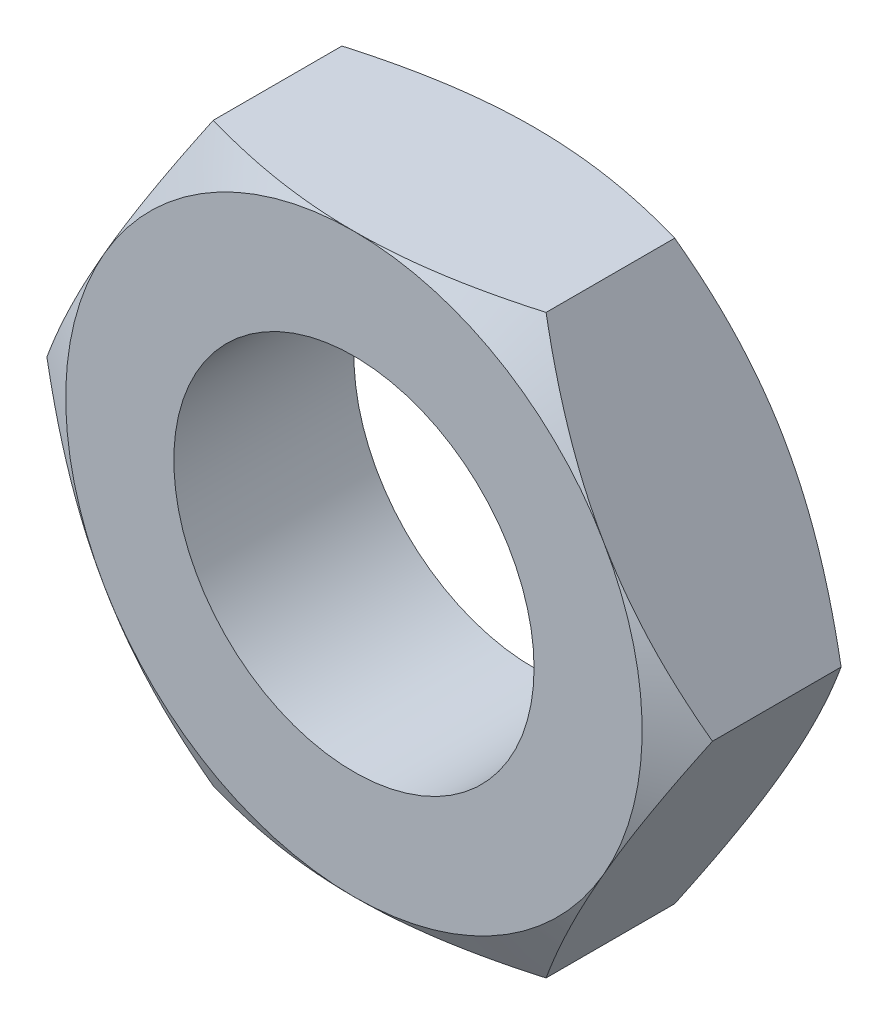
ISO-10303-21;
HEADER;
FILE_DESCRIPTION(('STEP AP214'),'2;1');
FILE_NAME('part.step','',(''),(''),'','','');
FILE_SCHEMA(('AUTOMOTIVE_DESIGN { 1 0 10303 214 1 1 1 1 }'));
ENDSEC;
DATA;
#1=APPLICATION_CONTEXT('core data for automotive mechanical design processes');
#2=APPLICATION_PROTOCOL_DEFINITION('international standard','automotive_design',2000,#1);
#3=PRODUCT_CONTEXT('',#1,'mechanical');
#4=PRODUCT('Part','Part','',(#3));
#5=PRODUCT_RELATED_PRODUCT_CATEGORY('part','',(#4));
#6=PRODUCT_DEFINITION_FORMATION('','',#4);
#7=PRODUCT_DEFINITION_CONTEXT('part definition',#1,'design');
#8=PRODUCT_DEFINITION('design','',#6,#7);
#9=PRODUCT_DEFINITION_SHAPE('','',#8);
#10=(LENGTH_UNIT() NAMED_UNIT(*) SI_UNIT(.MILLI.,.METRE.));
#11=(NAMED_UNIT(*) PLANE_ANGLE_UNIT() SI_UNIT($,.RADIAN.));
#12=(NAMED_UNIT(*) SI_UNIT($,.STERADIAN.) SOLID_ANGLE_UNIT());
#13=UNCERTAINTY_MEASURE_WITH_UNIT(LENGTH_MEASURE(1.E-05),#10,'distance_accuracy_value','');
#14=(GEOMETRIC_REPRESENTATION_CONTEXT(3) GLOBAL_UNCERTAINTY_ASSIGNED_CONTEXT((#13)) GLOBAL_UNIT_ASSIGNED_CONTEXT((#10,
#11,#12)) REPRESENTATION_CONTEXT('',''));
#15=CARTESIAN_POINT('',(0.,0.,0.));
#16=DIRECTION('',(0.,0.,1.));
#17=DIRECTION('',(1.,0.,0.));
#18=AXIS2_PLACEMENT_3D('',#15,#16,#17);
#19=CARTESIAN_POINT('',(9.23760430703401,0.,2.5));
#20=DIRECTION('',(-0.866025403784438,-0.5,0.));
#21=DIRECTION('',(0.5,-0.866025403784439,0.));
#22=AXIS2_PLACEMENT_3D('',#19,#20,#21);
#23=PLANE('',#22);
#24=CARTESIAN_POINT('',(4.61868668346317,8.0002,-1.78540215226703));
#25=CARTESIAN_POINT('',(4.72021302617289,7.8243512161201,-1.84400928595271));
#26=CARTESIAN_POINT('',(4.82211789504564,7.64784680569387,-1.89995659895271));
#27=CARTESIAN_POINT('',(5.02675523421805,7.29340453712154,-2.00579899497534));
#28=CARTESIAN_POINT('',(5.12948804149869,7.11546609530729,-2.05569146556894));
#29=CARTESIAN_POINT('',(5.43933133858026,6.57880176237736,-2.19530720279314));
#30=CARTESIAN_POINT('',(5.64766491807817,6.21795741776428,-2.27471882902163));
#31=CARTESIAN_POINT('',(5.95943209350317,5.67796082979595,-2.36783835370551));
#32=CARTESIAN_POINT('',(6.06193429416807,5.50042181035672,-2.39436541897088));
#33=CARTESIAN_POINT('',(6.26740224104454,5.14454088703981,-2.43884682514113));
#34=CARTESIAN_POINT('',(6.37036794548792,4.96619905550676,-2.45680192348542));
#35=CARTESIAN_POINT('',(6.57647664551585,4.60920831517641,-2.48368435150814));
#36=CARTESIAN_POINT('',(6.67961930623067,4.4305599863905,-2.49262192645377));
#37=CARTESIAN_POINT('',(6.88599991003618,4.07309829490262,-2.50127769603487));
#38=CARTESIAN_POINT('',(6.98923785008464,3.89428493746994,-2.50099617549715));
#39=CARTESIAN_POINT('',(7.18224506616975,3.5599866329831,-2.49185497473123));
#40=CARTESIAN_POINT('',(7.27202796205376,3.40447809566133,-2.48411039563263));
#41=CARTESIAN_POINT('',(7.45138347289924,3.09382523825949,-2.46179886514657));
#42=CARTESIAN_POINT('',(7.5409560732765,2.93868094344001,-2.44723145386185));
#43=CARTESIAN_POINT('',(7.80932710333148,2.47384868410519,-2.39363930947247));
#44=CARTESIAN_POINT('',(7.98765049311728,2.16498351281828,-2.34473135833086));
#45=CARTESIAN_POINT('',(8.34618890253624,1.5439767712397,-2.22246059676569));
#46=CARTESIAN_POINT('',(8.52635816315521,1.23191445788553,-2.14857947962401));
#47=CARTESIAN_POINT('',(8.88400987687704,0.612443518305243,-1.98089985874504));
#48=CARTESIAN_POINT('',(9.06149691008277,0.305026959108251,-1.88714073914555));
#49=CARTESIAN_POINT('',(9.23771977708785,-0.000199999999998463,-1.78540215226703));
#50=B_SPLINE_CURVE_WITH_KNOTS('',3,(#24,#25,#26,#27,#28,#29,#30,#31,#32,#33,#34,#35,#36,#37,#38,
#39,#40,#41,#42,#43,#44,#45,#46,#47,#48,#49),.UNSPECIFIED.,.F.,.F.,(4,2,2,2,2,2,2,2,2,2,2,2,4),
(0.,0.633973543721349,1.26821965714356,2.53934712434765,3.15934343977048,3.77928496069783,
4.39852133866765,5.01773858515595,5.55680239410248,6.09590254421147,7.17487077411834,
8.27776850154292,9.37850115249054),.UNSPECIFIED.);
#51=CARTESIAN_POINT('',(4.618802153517,8.,-1.78546882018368));
#52=VERTEX_POINT('',#51);
#53=CARTESIAN_POINT('',(6.92820323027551,4.,-2.5));
#54=VERTEX_POINT('',#53);
#55=EDGE_CURVE('E127',#52,#54,#50,.T.);
#56=ORIENTED_EDGE('',*,*,#55,.F.);
#57=DIRECTION('',(0.,0.,-1.));
#58=VECTOR('',#57,1.);
#59=CARTESIAN_POINT('',(4.618802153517,8.,2.5));
#60=LINE('',#59,#58);
#61=CARTESIAN_POINT('',(4.618802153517,8.,1.78546882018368));
#62=VERTEX_POINT('',#61);
#63=EDGE_CURVE('E269',#62,#52,#60,.T.);
#64=ORIENTED_EDGE('',*,*,#63,.F.);
#65=CARTESIAN_POINT('',(9.23771977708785,-0.00019999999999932,1.78540215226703));
#66=CARTESIAN_POINT('',(9.13619343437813,0.175648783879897,1.84400928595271));
#67=CARTESIAN_POINT('',(9.03428856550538,0.352153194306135,1.89995659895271));
#68=CARTESIAN_POINT('',(8.82965122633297,0.706595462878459,2.00579899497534));
#69=CARTESIAN_POINT('',(8.72691841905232,0.884533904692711,2.05569146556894));
#70=CARTESIAN_POINT('',(8.41707512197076,1.42119823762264,2.19530720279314));
#71=CARTESIAN_POINT('',(8.20874154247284,1.78204258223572,2.27471882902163));
#72=CARTESIAN_POINT('',(7.89697436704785,2.32203917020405,2.36783835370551));
#73=CARTESIAN_POINT('',(7.79447216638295,2.49957818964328,2.39436541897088));
#74=CARTESIAN_POINT('',(7.58900421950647,2.8554591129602,2.43884682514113));
#75=CARTESIAN_POINT('',(7.4860385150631,3.03380094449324,2.45680192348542));
#76=CARTESIAN_POINT('',(7.27992981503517,3.39079168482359,2.48368435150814));
#77=CARTESIAN_POINT('',(7.17678715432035,3.5694400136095,2.49262192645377));
#78=CARTESIAN_POINT('',(6.97040655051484,3.92690170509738,2.50127769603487));
#79=CARTESIAN_POINT('',(6.86716861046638,4.10571506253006,2.50099617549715));
#80=CARTESIAN_POINT('',(6.67416139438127,4.4400133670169,2.49185497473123));
#81=CARTESIAN_POINT('',(6.58437849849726,4.59552190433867,2.48411039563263));
#82=CARTESIAN_POINT('',(6.40502298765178,4.90617476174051,2.46179886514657));
#83=CARTESIAN_POINT('',(6.31545038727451,5.06131905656,2.44723145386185));
#84=CARTESIAN_POINT('',(6.04707935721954,5.52615131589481,2.39363930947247));
#85=CARTESIAN_POINT('',(5.86875596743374,5.83501648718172,2.34473135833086));
#86=CARTESIAN_POINT('',(5.51021755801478,6.4560232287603,2.22246059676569));
#87=CARTESIAN_POINT('',(5.3300482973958,6.76808554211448,2.14857947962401));
#88=CARTESIAN_POINT('',(4.97239658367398,7.38755648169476,1.98089985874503));
#89=CARTESIAN_POINT('',(4.79490955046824,7.69497304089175,1.88714073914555));
#90=CARTESIAN_POINT('',(4.61868668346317,8.0002,1.78540215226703));
#91=B_SPLINE_CURVE_WITH_KNOTS('',3,(#65,#66,#67,#68,#69,#70,#71,#72,#73,#74,#75,#76,#77,#78,#79,
#80,#81,#82,#83,#84,#85,#86,#87,#88,#89,#90),.UNSPECIFIED.,.F.,.F.,(4,2,2,2,2,2,2,2,2,2,2,2,4),
(0.,0.633973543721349,1.26821965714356,2.53934712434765,3.15934343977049,3.77928496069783,
4.39852133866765,5.01773858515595,5.55680239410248,6.09590254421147,7.17487077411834,
8.27776850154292,9.37850115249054),.UNSPECIFIED.);
#92=CARTESIAN_POINT('',(6.92820323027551,4.,2.5));
#93=VERTEX_POINT('',#92);
#94=EDGE_CURVE('E236',#93,#62,#91,.T.);
#95=ORIENTED_EDGE('',*,*,#94,.F.);
#96=CARTESIAN_POINT('',(9.23760430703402,0.,1.78546882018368));
#97=VERTEX_POINT('',#96);
#98=EDGE_CURVE('E242',#97,#93,#91,.T.);
#99=ORIENTED_EDGE('',*,*,#98,.F.);
#100=DIRECTION('',(0.,0.,-1.));
#101=VECTOR('',#100,1.);
#102=CARTESIAN_POINT('',(9.23760430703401,0.,2.5));
#103=LINE('',#102,#101);
#104=CARTESIAN_POINT('',(9.23760430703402,0.,-1.78546882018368));
#105=VERTEX_POINT('',#104);
#106=EDGE_CURVE('E162',#97,#105,#103,.T.);
#107=ORIENTED_EDGE('',*,*,#106,.T.);
#108=EDGE_CURVE('E141',#54,#105,#50,.T.);
#109=ORIENTED_EDGE('',*,*,#108,.F.);
#110=EDGE_LOOP('',(#56,#64,#95,#99,#107,#109));
#111=FACE_BOUND('',#110,.T.);
#112=ADVANCED_FACE('F37',(#111),#23,.F.);
#113=CARTESIAN_POINT('',(4.618802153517,8.,2.5));
#114=DIRECTION('',(0.,-1.,0.));
#115=DIRECTION('',(1.,0.,0.));
#116=AXIS2_PLACEMENT_3D('',#113,#114,#115);
#117=PLANE('',#116);
#118=CARTESIAN_POINT('',(-12.4723418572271,8.,1.43610504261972));
#119=CARTESIAN_POINT('',(-12.1223244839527,8.,1.26605220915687));
#120=CARTESIAN_POINT('',(-11.7715105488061,8.,1.09761120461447));
#121=CARTESIAN_POINT('',(-11.0678660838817,8.,0.764858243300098));
#122=CARTESIAN_POINT('',(-10.715035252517,8.,0.600546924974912));
#123=CARTESIAN_POINT('',(-10.0051475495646,8.,0.276146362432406));
#124=CARTESIAN_POINT('',(-9.64807816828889,8.,0.116084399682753));
#125=CARTESIAN_POINT('',(-8.93112179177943,8.,-0.19757493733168));
#126=CARTESIAN_POINT('',(-8.57123492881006,8.,-0.351172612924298));
#127=CARTESIAN_POINT('',(-7.83630502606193,8.,-0.655063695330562));
#128=CARTESIAN_POINT('',(-7.46114974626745,8.,-0.805087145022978));
#129=CARTESIAN_POINT('',(-6.70647567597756,8.,-1.09393796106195));
#130=CARTESIAN_POINT('',(-6.32695640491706,8.,-1.23276408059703));
#131=CARTESIAN_POINT('',(-5.56363479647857,8.,-1.49562422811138));
#132=CARTESIAN_POINT('',(-5.17984267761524,8.,-1.61968761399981));
#133=CARTESIAN_POINT('',(-4.4067675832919,8.,-1.84908673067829));
#134=CARTESIAN_POINT('',(-4.01748635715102,8.,-1.95442828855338));
#135=CARTESIAN_POINT('',(-3.23526878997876,8.,-2.14081518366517));
#136=CARTESIAN_POINT('',(-2.84236453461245,8.,-2.22199156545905));
#137=CARTESIAN_POINT('',(-2.24937878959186,8.,-2.32213973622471));
#138=CARTESIAN_POINT('',(-2.05109822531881,8.,-2.35192103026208));
#139=CARTESIAN_POINT('',(-1.65352935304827,8.,-2.40369569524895));
#140=CARTESIAN_POINT('',(-1.45424114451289,8.,-2.42568982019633));
#141=CARTESIAN_POINT('',(-1.05755782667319,8.,-2.46117249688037));
#142=CARTESIAN_POINT('',(-0.860172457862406,8.,-2.47476950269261));
#143=CARTESIAN_POINT('',(-0.465003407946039,8.,-2.49360090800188));
#144=CARTESIAN_POINT('',(-0.267219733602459,8.,-2.49883544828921));
#145=CARTESIAN_POINT('',(0.128393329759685,8.,-2.50081683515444));
#146=CARTESIAN_POINT('',(0.326222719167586,8.,-2.49756360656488));
#147=CARTESIAN_POINT('',(0.72156675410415,8.,-2.48264972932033));
#148=CARTESIAN_POINT('',(0.919081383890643,8.,-2.4709886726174));
#149=CARTESIAN_POINT('',(1.39170153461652,8.,-2.43327468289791));
#150=CARTESIAN_POINT('',(1.66650460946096,8.,-2.40334762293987));
#151=CARTESIAN_POINT('',(2.21410196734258,8.,-2.3288352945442));
#152=CARTESIAN_POINT('',(2.48689598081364,8.,-2.2842480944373));
#153=CARTESIAN_POINT('',(3.3019276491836,8.,-2.13085810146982));
#154=CARTESIAN_POINT('',(3.84052664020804,8.,-2.00245299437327));
#155=CARTESIAN_POINT('',(4.64614211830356,8.,-1.7793473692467));
#156=CARTESIAN_POINT('',(4.91732273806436,8.,-1.69881541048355));
#157=CARTESIAN_POINT('',(5.4570501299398,8.,-1.52928372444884));
#158=CARTESIAN_POINT('',(5.72559688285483,8.,-1.44028393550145));
#159=CARTESIAN_POINT('',(6.26014158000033,8.,-1.25525344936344));
#160=CARTESIAN_POINT('',(6.52614028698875,8.,-1.15922493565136));
#161=CARTESIAN_POINT('',(7.05592421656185,8.,-0.961277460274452));
#162=CARTESIAN_POINT('',(7.31970948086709,8.,-0.859358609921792));
#163=CARTESIAN_POINT('',(8.00201017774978,8.,-0.58837998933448));
#164=CARTESIAN_POINT('',(8.4190136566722,8.,-0.415517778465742));
#165=CARTESIAN_POINT('',(9.24898317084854,8.,-0.0603265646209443));
#166=CARTESIAN_POINT('',(9.66194883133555,8.,0.122003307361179));
#167=CARTESIAN_POINT('',(10.4847174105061,8.,0.493990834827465));
#168=CARTESIAN_POINT('',(10.8945192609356,8.,0.683650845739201));
#169=CARTESIAN_POINT('',(11.7114324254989,8.,1.06862760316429));
#170=CARTESIAN_POINT('',(12.1185438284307,8.,1.26394416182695));
#171=CARTESIAN_POINT('',(12.9311603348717,8.,1.65933416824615));
#172=CARTESIAN_POINT('',(13.3366623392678,8.,1.85941397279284));
#173=CARTESIAN_POINT('',(14.1458718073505,8.,2.26317129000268));
#174=CARTESIAN_POINT('',(14.5495792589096,8.,2.46684882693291));
#175=CARTESIAN_POINT('',(15.3554319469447,8.,2.87708319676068));
#176=CARTESIAN_POINT('',(15.7575774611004,8.,3.08363948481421));
#177=CARTESIAN_POINT('',(16.5606283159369,8.,3.49915025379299));
#178=CARTESIAN_POINT('',(16.9615336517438,8.,3.70810474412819));
#179=CARTESIAN_POINT('',(18.0836471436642,8.,4.29649031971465));
#180=CARTESIAN_POINT('',(18.8036875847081,8.,4.67814802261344));
#181=CARTESIAN_POINT('',(20.2412932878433,8.,5.44617514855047));
#182=CARTESIAN_POINT('',(20.9588584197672,8.,5.83254481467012));
#183=CARTESIAN_POINT('',(22.3898964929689,8.,6.60764783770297));
#184=CARTESIAN_POINT('',(23.1033752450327,8.,6.99637047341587));
#185=CARTESIAN_POINT('',(24.1724528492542,8.,7.58147763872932));
#186=CARTESIAN_POINT('',(24.5286097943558,8.,7.77684384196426));
#187=CARTESIAN_POINT('',(25.2405906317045,8.,8.16818102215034));
#188=CARTESIAN_POINT('',(25.5964145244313,8.,8.36415199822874));
#189=CARTESIAN_POINT('',(25.9520918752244,8.,8.56038864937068));
#190=B_SPLINE_CURVE_WITH_KNOTS('',3,(#118,#119,#120,#121,#122,#123,#124,#125,#126,#127,#128,
#129,#130,#131,#132,#133,#134,#135,#136,#137,#138,#139,#140,#141,#142,#143,#144,#145,#146,#147,
#148,#149,#150,#151,#152,#153,#154,#155,#156,#157,#158,#159,#160,#161,#162,#163,#164,#165,#166,
#167,#168,#169,#170,#171,#172,#173,#174,#175,#176,#177,#178,#179,#180,#181,#182,#183,#184,#185,
#186,#187,#188,#189),.UNSPECIFIED.,.F.,.F.,(4,2,2,2,2,2,2,2,2,2,2,2,2,2,2,2,2,2,2,2,2,2,2,2,2,2,
2,2,2,2,2,2,2,2,2,4),(0.,1.16743466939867,2.33504872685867,3.50890763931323,4.68271177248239,
5.89469375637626,7.10681050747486,8.31647500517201,9.52576233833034,10.7283671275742,
11.3297522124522,11.9310790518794,12.524467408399,13.1178457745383,13.7112293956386,
14.3046418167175,15.133458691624,15.9623848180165,17.6211015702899,18.4696861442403,
19.3182768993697,20.1666051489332,21.0149173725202,22.3689850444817,23.7231772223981,
25.0778082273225,26.4323942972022,27.788902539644,29.1454199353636,30.501683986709,
31.8579533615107,34.3027346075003,36.7476425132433,39.1851361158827,40.4037995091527,
41.6224611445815),.UNSPECIFIED.);
#191=CARTESIAN_POINT('',(-4.61880215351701,8.,-1.78546882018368));
#192=VERTEX_POINT('',#191);
#193=CARTESIAN_POINT('',(0.,8.,-2.5));
#194=VERTEX_POINT('',#193);
#195=EDGE_CURVE('E53',#192,#194,#190,.T.);
#196=ORIENTED_EDGE('',*,*,#195,.F.);
#197=DIRECTION('',(0.,0.,-1.));
#198=VECTOR('',#197,1.);
#199=CARTESIAN_POINT('',(-4.61880215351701,8.,2.5));
#200=LINE('',#199,#198);
#201=CARTESIAN_POINT('',(-4.61880215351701,8.,1.78546882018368));
#202=VERTEX_POINT('',#201);
#203=EDGE_CURVE('E265',#202,#192,#200,.T.);
#204=ORIENTED_EDGE('',*,*,#203,.F.);
#205=CARTESIAN_POINT('',(-12.4723418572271,8.,-1.43610504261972));
#206=CARTESIAN_POINT('',(-12.1223244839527,8.,-1.26605220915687));
#207=CARTESIAN_POINT('',(-11.7715105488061,8.,-1.09761120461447));
#208=CARTESIAN_POINT('',(-11.0678660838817,8.,-0.764858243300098));
#209=CARTESIAN_POINT('',(-10.715035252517,8.,-0.600546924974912));
#210=CARTESIAN_POINT('',(-10.0051475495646,8.,-0.276146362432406));
#211=CARTESIAN_POINT('',(-9.64807816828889,8.,-0.116084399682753));
#212=CARTESIAN_POINT('',(-8.93112179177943,8.,0.19757493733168));
#213=CARTESIAN_POINT('',(-8.57123492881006,8.,0.351172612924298));
#214=CARTESIAN_POINT('',(-7.83630502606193,8.,0.655063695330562));
#215=CARTESIAN_POINT('',(-7.46114974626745,8.,0.805087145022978));
#216=CARTESIAN_POINT('',(-6.70647567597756,8.,1.09393796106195));
#217=CARTESIAN_POINT('',(-6.32695640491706,8.,1.23276408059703));
#218=CARTESIAN_POINT('',(-5.56363479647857,8.,1.49562422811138));
#219=CARTESIAN_POINT('',(-5.17984267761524,8.,1.61968761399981));
#220=CARTESIAN_POINT('',(-4.4067675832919,8.,1.84908673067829));
#221=CARTESIAN_POINT('',(-4.01748635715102,8.,1.95442828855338));
#222=CARTESIAN_POINT('',(-3.23526878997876,8.,2.14081518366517));
#223=CARTESIAN_POINT('',(-2.84236453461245,8.,2.22199156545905));
#224=CARTESIAN_POINT('',(-2.24937878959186,8.,2.32213973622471));
#225=CARTESIAN_POINT('',(-2.05109822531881,8.,2.35192103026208));
#226=CARTESIAN_POINT('',(-1.65352935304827,8.,2.40369569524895));
#227=CARTESIAN_POINT('',(-1.45424114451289,8.,2.42568982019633));
#228=CARTESIAN_POINT('',(-1.05755782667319,8.,2.46117249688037));
#229=CARTESIAN_POINT('',(-0.860172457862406,8.,2.47476950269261));
#230=CARTESIAN_POINT('',(-0.465003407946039,8.,2.49360090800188));
#231=CARTESIAN_POINT('',(-0.267219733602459,8.,2.49883544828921));
#232=CARTESIAN_POINT('',(0.128393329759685,8.,2.50081683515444));
#233=CARTESIAN_POINT('',(0.326222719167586,8.,2.49756360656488));
#234=CARTESIAN_POINT('',(0.72156675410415,8.,2.48264972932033));
#235=CARTESIAN_POINT('',(0.919081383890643,8.,2.4709886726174));
#236=CARTESIAN_POINT('',(1.39170153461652,8.,2.43327468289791));
#237=CARTESIAN_POINT('',(1.66650460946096,8.,2.40334762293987));
#238=CARTESIAN_POINT('',(2.21410196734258,8.,2.3288352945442));
#239=CARTESIAN_POINT('',(2.48689598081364,8.,2.2842480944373));
#240=CARTESIAN_POINT('',(3.3019276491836,8.,2.13085810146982));
#241=CARTESIAN_POINT('',(3.84052664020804,8.,2.00245299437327));
#242=CARTESIAN_POINT('',(4.64614211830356,8.,1.7793473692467));
#243=CARTESIAN_POINT('',(4.91732273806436,8.,1.69881541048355));
#244=CARTESIAN_POINT('',(5.4570501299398,8.,1.52928372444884));
#245=CARTESIAN_POINT('',(5.72559688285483,8.,1.44028393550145));
#246=CARTESIAN_POINT('',(6.26014158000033,8.,1.25525344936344));
#247=CARTESIAN_POINT('',(6.52614028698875,8.,1.15922493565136));
#248=CARTESIAN_POINT('',(7.05592421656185,8.,0.961277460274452));
#249=CARTESIAN_POINT('',(7.31970948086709,8.,0.859358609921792));
#250=CARTESIAN_POINT('',(8.00201017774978,8.,0.58837998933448));
#251=CARTESIAN_POINT('',(8.4190136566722,8.,0.415517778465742));
#252=CARTESIAN_POINT('',(9.24898317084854,8.,0.0603265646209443));
#253=CARTESIAN_POINT('',(9.66194883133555,8.,-0.122003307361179));
#254=CARTESIAN_POINT('',(10.4847174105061,8.,-0.493990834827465));
#255=CARTESIAN_POINT('',(10.8945192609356,8.,-0.683650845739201));
#256=CARTESIAN_POINT('',(11.7114324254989,8.,-1.06862760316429));
#257=CARTESIAN_POINT('',(12.1185438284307,8.,-1.26394416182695));
#258=CARTESIAN_POINT('',(12.9311603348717,8.,-1.65933416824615));
#259=CARTESIAN_POINT('',(13.3366623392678,8.,-1.85941397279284));
#260=CARTESIAN_POINT('',(14.1458718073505,8.,-2.26317129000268));
#261=CARTESIAN_POINT('',(14.5495792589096,8.,-2.46684882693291));
#262=CARTESIAN_POINT('',(15.3554319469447,8.,-2.87708319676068));
#263=CARTESIAN_POINT('',(15.7575774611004,8.,-3.08363948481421));
#264=CARTESIAN_POINT('',(16.5606283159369,8.,-3.49915025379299));
#265=CARTESIAN_POINT('',(16.9615336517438,8.,-3.70810474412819));
#266=CARTESIAN_POINT('',(18.0836471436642,8.,-4.29649031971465));
#267=CARTESIAN_POINT('',(18.8036875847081,8.,-4.67814802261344));
#268=CARTESIAN_POINT('',(20.2412932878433,8.,-5.44617514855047));
#269=CARTESIAN_POINT('',(20.9588584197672,8.,-5.83254481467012));
#270=CARTESIAN_POINT('',(22.3898964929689,8.,-6.60764783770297));
#271=CARTESIAN_POINT('',(23.1033752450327,8.,-6.99637047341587));
#272=CARTESIAN_POINT('',(24.1724528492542,8.,-7.58147763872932));
#273=CARTESIAN_POINT('',(24.5286097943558,8.,-7.77684384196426));
#274=CARTESIAN_POINT('',(25.2405906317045,8.,-8.16818102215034));
#275=CARTESIAN_POINT('',(25.5964145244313,8.,-8.36415199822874));
#276=CARTESIAN_POINT('',(25.9520918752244,8.,-8.56038864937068));
#277=B_SPLINE_CURVE_WITH_KNOTS('',3,(#205,#206,#207,#208,#209,#210,#211,#212,#213,#214,#215,
#216,#217,#218,#219,#220,#221,#222,#223,#224,#225,#226,#227,#228,#229,#230,#231,#232,#233,#234,
#235,#236,#237,#238,#239,#240,#241,#242,#243,#244,#245,#246,#247,#248,#249,#250,#251,#252,#253,
#254,#255,#256,#257,#258,#259,#260,#261,#262,#263,#264,#265,#266,#267,#268,#269,#270,#271,#272,
#273,#274,#275,#276),.UNSPECIFIED.,.F.,.F.,(4,2,2,2,2,2,2,2,2,2,2,2,2,2,2,2,2,2,2,2,2,2,2,2,2,2,
2,2,2,2,2,2,2,2,2,4),(0.,1.16743466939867,2.33504872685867,3.50890763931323,4.68271177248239,
5.89469375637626,7.10681050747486,8.31647500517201,9.52576233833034,10.7283671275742,
11.3297522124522,11.9310790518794,12.524467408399,13.1178457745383,13.7112293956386,
14.3046418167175,15.133458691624,15.9623848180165,17.6211015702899,18.4696861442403,
19.3182768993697,20.1666051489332,21.0149173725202,22.3689850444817,23.7231772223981,
25.0778082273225,26.4323942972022,27.788902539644,29.1454199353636,30.501683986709,
31.8579533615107,34.3027346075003,36.7476425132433,39.1851361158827,40.4037995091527,
41.6224611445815),.UNSPECIFIED.);
#278=CARTESIAN_POINT('',(0.,8.,2.5));
#279=VERTEX_POINT('',#278);
#280=EDGE_CURVE('E222',#279,#202,#277,.F.);
#281=ORIENTED_EDGE('',*,*,#280,.F.);
#282=EDGE_CURVE('E229',#62,#279,#277,.F.);
#283=ORIENTED_EDGE('',*,*,#282,.F.);
#284=ORIENTED_EDGE('',*,*,#63,.T.);
#285=EDGE_CURVE('E134',#194,#52,#190,.T.);
#286=ORIENTED_EDGE('',*,*,#285,.F.);
#287=EDGE_LOOP('',(#196,#204,#281,#283,#284,#286));
#288=FACE_BOUND('',#287,.T.);
#289=ADVANCED_FACE('F214',(#288),#117,.F.);
#290=CARTESIAN_POINT('',(-4.61880215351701,8.,2.5));
#291=DIRECTION('',(0.866025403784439,-0.5,0.));
#292=DIRECTION('',(0.5,0.866025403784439,0.));
#293=AXIS2_PLACEMENT_3D('',#290,#291,#292);
#294=PLANE('',#293);
#295=CARTESIAN_POINT('',(-9.23771977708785,-0.000199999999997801,-1.78540215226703));
#296=CARTESIAN_POINT('',(-9.13619343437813,0.175648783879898,-1.84400928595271));
#297=CARTESIAN_POINT('',(-9.03428856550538,0.352153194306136,-1.89995659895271));
#298=CARTESIAN_POINT('',(-8.82965122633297,0.706595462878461,-2.00579899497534));
#299=CARTESIAN_POINT('',(-8.72691841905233,0.884533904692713,-2.05569146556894));
#300=CARTESIAN_POINT('',(-8.41707512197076,1.42119823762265,-2.19530720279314));
#301=CARTESIAN_POINT('',(-8.20874154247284,1.78204258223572,-2.27471882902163));
#302=CARTESIAN_POINT('',(-7.89697436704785,2.32203917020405,-2.36783835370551));
#303=CARTESIAN_POINT('',(-7.79447216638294,2.49957818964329,-2.39436541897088));
#304=CARTESIAN_POINT('',(-7.58900421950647,2.8554591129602,-2.43884682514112));
#305=CARTESIAN_POINT('',(-7.4860385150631,3.03380094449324,-2.45680192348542));
#306=CARTESIAN_POINT('',(-7.27992981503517,3.3907916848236,-2.48368435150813));
#307=CARTESIAN_POINT('',(-7.17678715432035,3.5694400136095,-2.49262192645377));
#308=CARTESIAN_POINT('',(-6.97040655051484,3.92690170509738,-2.50127769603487));
#309=CARTESIAN_POINT('',(-6.86716861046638,4.10571506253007,-2.50099617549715));
#310=CARTESIAN_POINT('',(-6.67416139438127,4.44001336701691,-2.49185497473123));
#311=CARTESIAN_POINT('',(-6.58437849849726,4.59552190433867,-2.48411039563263));
#312=CARTESIAN_POINT('',(-6.40502298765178,4.90617476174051,-2.46179886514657));
#313=CARTESIAN_POINT('',(-6.31545038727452,5.06131905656,-2.44723145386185));
#314=CARTESIAN_POINT('',(-6.04707935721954,5.52615131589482,-2.39363930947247));
#315=CARTESIAN_POINT('',(-5.86875596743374,5.83501648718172,-2.34473135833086));
#316=CARTESIAN_POINT('',(-5.51021755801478,6.4560232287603,-2.22246059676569));
#317=CARTESIAN_POINT('',(-5.33004829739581,6.76808554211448,-2.148579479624));
#318=CARTESIAN_POINT('',(-4.97239658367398,7.38755648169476,-1.98089985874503));
#319=CARTESIAN_POINT('',(-4.79490955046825,7.69497304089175,-1.88714073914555));
#320=CARTESIAN_POINT('',(-4.61868668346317,8.0002,-1.78540215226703));
#321=B_SPLINE_CURVE_WITH_KNOTS('',3,(#295,#296,#297,#298,#299,#300,#301,#302,#303,#304,#305,
#306,#307,#308,#309,#310,#311,#312,#313,#314,#315,#316,#317,#318,#319,#320),.UNSPECIFIED.,.F.,
.F.,(4,2,2,2,2,2,2,2,2,2,2,2,4),(0.,0.633973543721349,1.26821965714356,2.53934712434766,
3.15934343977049,3.77928496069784,4.39852133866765,5.01773858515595,5.55680239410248,
6.09590254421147,7.17487077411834,8.27776850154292,9.37850115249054),.UNSPECIFIED.);
#322=CARTESIAN_POINT('',(-9.23760430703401,0.,-1.78546882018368));
#323=VERTEX_POINT('',#322);
#324=CARTESIAN_POINT('',(-6.92820323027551,4.,-2.5));
#325=VERTEX_POINT('',#324);
#326=EDGE_CURVE('E61',#323,#325,#321,.T.);
#327=ORIENTED_EDGE('',*,*,#326,.F.);
#328=DIRECTION('',(0.,0.,-1.));
#329=VECTOR('',#328,1.);
#330=CARTESIAN_POINT('',(-9.23760430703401,0.,2.5));
#331=LINE('',#330,#329);
#332=CARTESIAN_POINT('',(-9.23760430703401,0.,1.78546882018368));
#333=VERTEX_POINT('',#332);
#334=EDGE_CURVE('E261',#333,#323,#331,.T.);
#335=ORIENTED_EDGE('',*,*,#334,.F.);
#336=CARTESIAN_POINT('',(-4.61868668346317,8.0002,1.78540215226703));
#337=CARTESIAN_POINT('',(-4.7202130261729,7.8243512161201,1.84400928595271));
#338=CARTESIAN_POINT('',(-4.82211789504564,7.64784680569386,1.89995659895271));
#339=CARTESIAN_POINT('',(-5.02675523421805,7.29340453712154,2.00579899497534));
#340=CARTESIAN_POINT('',(-5.1294880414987,7.11546609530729,2.05569146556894));
#341=CARTESIAN_POINT('',(-5.43933133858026,6.57880176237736,2.19530720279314));
#342=CARTESIAN_POINT('',(-5.64766491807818,6.21795741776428,2.27471882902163));
#343=CARTESIAN_POINT('',(-5.95943209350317,5.67796082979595,2.36783835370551));
#344=CARTESIAN_POINT('',(-6.06193429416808,5.50042181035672,2.39436541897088));
#345=CARTESIAN_POINT('',(-6.26740224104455,5.1445408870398,2.43884682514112));
#346=CARTESIAN_POINT('',(-6.37036794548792,4.96619905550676,2.45680192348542));
#347=CARTESIAN_POINT('',(-6.57647664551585,4.60920831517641,2.48368435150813));
#348=CARTESIAN_POINT('',(-6.67961930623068,4.4305599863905,2.49262192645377));
#349=CARTESIAN_POINT('',(-6.88599991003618,4.07309829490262,2.50127769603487));
#350=CARTESIAN_POINT('',(-6.98923785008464,3.89428493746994,2.50099617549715));
#351=CARTESIAN_POINT('',(-7.18224506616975,3.5599866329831,2.49185497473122));
#352=CARTESIAN_POINT('',(-7.27202796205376,3.40447809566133,2.48411039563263));
#353=CARTESIAN_POINT('',(-7.45138347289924,3.09382523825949,2.46179886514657));
#354=CARTESIAN_POINT('',(-7.5409560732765,2.93868094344,2.44723145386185));
#355=CARTESIAN_POINT('',(-7.80932710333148,2.47384868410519,2.39363930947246));
#356=CARTESIAN_POINT('',(-7.98765049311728,2.16498351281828,2.34473135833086));
#357=CARTESIAN_POINT('',(-8.34618890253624,1.5439767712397,2.22246059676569));
#358=CARTESIAN_POINT('',(-8.52635816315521,1.23191445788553,2.14857947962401));
#359=CARTESIAN_POINT('',(-8.88400987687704,0.612443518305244,1.98089985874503));
#360=CARTESIAN_POINT('',(-9.06149691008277,0.305026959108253,1.88714073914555));
#361=CARTESIAN_POINT('',(-9.23771977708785,-0.000199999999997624,1.78540215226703));
#362=B_SPLINE_CURVE_WITH_KNOTS('',3,(#336,#337,#338,#339,#340,#341,#342,#343,#344,#345,#346,
#347,#348,#349,#350,#351,#352,#353,#354,#355,#356,#357,#358,#359,#360,#361),.UNSPECIFIED.,.F.,
.F.,(4,2,2,2,2,2,2,2,2,2,2,2,4),(0.,0.633973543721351,1.26821965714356,2.53934712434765,
3.15934343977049,3.77928496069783,4.39852133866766,5.01773858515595,5.55680239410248,
6.09590254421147,7.17487077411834,8.27776850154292,9.37850115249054),.UNSPECIFIED.);
#363=CARTESIAN_POINT('',(-6.92820323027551,4.,2.5));
#364=VERTEX_POINT('',#363);
#365=EDGE_CURVE('E231',#364,#333,#362,.T.);
#366=ORIENTED_EDGE('',*,*,#365,.F.);
#367=EDGE_CURVE('E230',#202,#364,#362,.T.);
#368=ORIENTED_EDGE('',*,*,#367,.F.);
#369=ORIENTED_EDGE('',*,*,#203,.T.);
#370=EDGE_CURVE('E208',#325,#192,#321,.T.);
#371=ORIENTED_EDGE('',*,*,#370,.F.);
#372=EDGE_LOOP('',(#327,#335,#366,#368,#369,#371));
#373=FACE_BOUND('',#372,.T.);
#374=ADVANCED_FACE('F217',(#373),#294,.F.);
#375=CARTESIAN_POINT('',(-9.23760430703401,0.,2.5));
#376=DIRECTION('',(0.866025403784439,0.5,0.));
#377=DIRECTION('',(-0.5,0.866025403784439,0.));
#378=AXIS2_PLACEMENT_3D('',#375,#376,#377);
#379=PLANE('',#378);
#380=CARTESIAN_POINT('',(-4.61868668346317,-8.0002,-1.78540215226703));
#381=CARTESIAN_POINT('',(-4.72021302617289,-7.8243512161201,-1.84400928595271));
#382=CARTESIAN_POINT('',(-4.82211789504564,-7.64784680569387,-1.89995659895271));
#383=CARTESIAN_POINT('',(-5.02675523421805,-7.29340453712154,-2.00579899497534));
#384=CARTESIAN_POINT('',(-5.12948804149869,-7.11546609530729,-2.05569146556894));
#385=CARTESIAN_POINT('',(-5.43933133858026,-6.57880176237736,-2.19530720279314));
#386=CARTESIAN_POINT('',(-5.64766491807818,-6.21795741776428,-2.27471882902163));
#387=CARTESIAN_POINT('',(-5.95943209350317,-5.67796082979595,-2.36783835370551));
#388=CARTESIAN_POINT('',(-6.06193429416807,-5.50042181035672,-2.39436541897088));
#389=CARTESIAN_POINT('',(-6.26740224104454,-5.1445408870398,-2.43884682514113));
#390=CARTESIAN_POINT('',(-6.37036794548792,-4.96619905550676,-2.45680192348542));
#391=CARTESIAN_POINT('',(-6.57647664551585,-4.60920831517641,-2.48368435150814));
#392=CARTESIAN_POINT('',(-6.67961930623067,-4.4305599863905,-2.49262192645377));
#393=CARTESIAN_POINT('',(-6.88599991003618,-4.07309829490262,-2.50127769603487));
#394=CARTESIAN_POINT('',(-6.98923785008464,-3.89428493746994,-2.50099617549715));
#395=CARTESIAN_POINT('',(-7.18224506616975,-3.5599866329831,-2.49185497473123));
#396=CARTESIAN_POINT('',(-7.27202796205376,-3.40447809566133,-2.48411039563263));
#397=CARTESIAN_POINT('',(-7.45138347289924,-3.09382523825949,-2.46179886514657));
#398=CARTESIAN_POINT('',(-7.5409560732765,-2.93868094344,-2.44723145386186));
#399=CARTESIAN_POINT('',(-7.80932710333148,-2.47384868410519,-2.39363930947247));
#400=CARTESIAN_POINT('',(-7.98765049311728,-2.16498351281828,-2.34473135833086));
#401=CARTESIAN_POINT('',(-8.34618890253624,-1.5439767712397,-2.22246059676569));
#402=CARTESIAN_POINT('',(-8.52635816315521,-1.23191445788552,-2.14857947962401));
#403=CARTESIAN_POINT('',(-8.88400987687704,-0.61244351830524,-1.98089985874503));
#404=CARTESIAN_POINT('',(-9.06149691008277,-0.305026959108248,-1.88714073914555));
#405=CARTESIAN_POINT('',(-9.23771977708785,0.00020000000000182,-1.78540215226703));
#406=B_SPLINE_CURVE_WITH_KNOTS('',3,(#380,#381,#382,#383,#384,#385,#386,#387,#388,#389,#390,
#391,#392,#393,#394,#395,#396,#397,#398,#399,#400,#401,#402,#403,#404,#405),.UNSPECIFIED.,.F.,
.F.,(4,2,2,2,2,2,2,2,2,2,2,2,4),(0.,0.63397354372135,1.26821965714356,2.53934712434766,
3.15934343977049,3.77928496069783,4.39852133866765,5.01773858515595,5.55680239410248,
6.09590254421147,7.17487077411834,8.27776850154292,9.37850115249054),.UNSPECIFIED.);
#407=CARTESIAN_POINT('',(-4.618802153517,-8.,-1.78546882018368));
#408=VERTEX_POINT('',#407);
#409=CARTESIAN_POINT('',(-6.92820323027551,-4.,-2.5));
#410=VERTEX_POINT('',#409);
#411=EDGE_CURVE('E178',#408,#410,#406,.T.);
#412=ORIENTED_EDGE('',*,*,#411,.F.);
#413=DIRECTION('',(0.,0.,-1.));
#414=VECTOR('',#413,1.);
#415=CARTESIAN_POINT('',(-4.618802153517,-8.,2.5));
#416=LINE('',#415,#414);
#417=CARTESIAN_POINT('',(-4.618802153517,-8.,1.78546882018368));
#418=VERTEX_POINT('',#417);
#419=EDGE_CURVE('E257',#418,#408,#416,.T.);
#420=ORIENTED_EDGE('',*,*,#419,.F.);
#421=CARTESIAN_POINT('',(-9.23771977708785,0.000200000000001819,1.78540215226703));
#422=CARTESIAN_POINT('',(-9.13619343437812,-0.175648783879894,1.84400928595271));
#423=CARTESIAN_POINT('',(-9.03428856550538,-0.352153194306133,1.89995659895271));
#424=CARTESIAN_POINT('',(-8.82965122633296,-0.706595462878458,2.00579899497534));
#425=CARTESIAN_POINT('',(-8.72691841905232,-0.88453390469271,2.05569146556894));
#426=CARTESIAN_POINT('',(-8.41707512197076,-1.42119823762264,2.19530720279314));
#427=CARTESIAN_POINT('',(-8.20874154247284,-1.78204258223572,2.27471882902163));
#428=CARTESIAN_POINT('',(-7.89697436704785,-2.32203917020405,2.36783835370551));
#429=CARTESIAN_POINT('',(-7.79447216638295,-2.49957818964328,2.39436541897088));
#430=CARTESIAN_POINT('',(-7.58900421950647,-2.8554591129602,2.43884682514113));
#431=CARTESIAN_POINT('',(-7.4860385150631,-3.03380094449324,2.45680192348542));
#432=CARTESIAN_POINT('',(-7.27992981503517,-3.39079168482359,2.48368435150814));
#433=CARTESIAN_POINT('',(-7.17678715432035,-3.5694400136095,2.49262192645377));
#434=CARTESIAN_POINT('',(-6.97040655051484,-3.92690170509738,2.50127769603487));
#435=CARTESIAN_POINT('',(-6.86716861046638,-4.10571506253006,2.50099617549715));
#436=CARTESIAN_POINT('',(-6.67416139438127,-4.4400133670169,2.49185497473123));
#437=CARTESIAN_POINT('',(-6.58437849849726,-4.59552190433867,2.48411039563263));
#438=CARTESIAN_POINT('',(-6.40502298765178,-4.90617476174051,2.46179886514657));
#439=CARTESIAN_POINT('',(-6.31545038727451,-5.06131905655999,2.44723145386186));
#440=CARTESIAN_POINT('',(-6.04707935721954,-5.52615131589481,2.39363930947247));
#441=CARTESIAN_POINT('',(-5.86875596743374,-5.83501648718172,2.34473135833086));
#442=CARTESIAN_POINT('',(-5.51021755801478,-6.4560232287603,2.22246059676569));
#443=CARTESIAN_POINT('',(-5.3300482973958,-6.76808554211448,2.14857947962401));
#444=CARTESIAN_POINT('',(-4.97239658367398,-7.38755648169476,1.98089985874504));
#445=CARTESIAN_POINT('',(-4.79490955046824,-7.69497304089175,1.88714073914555));
#446=CARTESIAN_POINT('',(-4.61868668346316,-8.0002,1.78540215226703));
#447=B_SPLINE_CURVE_WITH_KNOTS('',3,(#421,#422,#423,#424,#425,#426,#427,#428,#429,#430,#431,
#432,#433,#434,#435,#436,#437,#438,#439,#440,#441,#442,#443,#444,#445,#446),.UNSPECIFIED.,.F.,
.F.,(4,2,2,2,2,2,2,2,2,2,2,2,4),(0.,0.633973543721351,1.26821965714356,2.53934712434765,
3.15934343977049,3.77928496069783,4.39852133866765,5.01773858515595,5.55680239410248,
6.09590254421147,7.17487077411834,8.27776850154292,9.37850115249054),.UNSPECIFIED.);
#448=CARTESIAN_POINT('',(-6.92820323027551,-4.,2.5));
#449=VERTEX_POINT('',#448);
#450=EDGE_CURVE('E298',#449,#418,#447,.T.);
#451=ORIENTED_EDGE('',*,*,#450,.F.);
#452=EDGE_CURVE('E303',#333,#449,#447,.T.);
#453=ORIENTED_EDGE('',*,*,#452,.F.);
#454=ORIENTED_EDGE('',*,*,#334,.T.);
#455=EDGE_CURVE('E371',#410,#323,#406,.T.);
#456=ORIENTED_EDGE('',*,*,#455,.F.);
#457=EDGE_LOOP('',(#412,#420,#451,#453,#454,#456));
#458=FACE_BOUND('',#457,.T.);
#459=ADVANCED_FACE('F286',(#458),#379,.F.);
#460=CARTESIAN_POINT('',(-4.618802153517,-8.,2.5));
#461=DIRECTION('',(0.,1.,0.));
#462=DIRECTION('',(0.,0.,1.));
#463=AXIS2_PLACEMENT_3D('',#460,#461,#462);
#464=PLANE('',#463);
#465=CARTESIAN_POINT('',(-12.4723418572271,-8.,1.43610504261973));
#466=CARTESIAN_POINT('',(-12.1223244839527,-8.,1.26605220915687));
#467=CARTESIAN_POINT('',(-11.7715105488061,-8.,1.09761120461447));
#468=CARTESIAN_POINT('',(-11.0678660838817,-8.,0.764858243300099));
#469=CARTESIAN_POINT('',(-10.715035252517,-8.,0.600546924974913));
#470=CARTESIAN_POINT('',(-10.0051475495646,-8.,0.276146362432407));
#471=CARTESIAN_POINT('',(-9.64807816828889,-8.,0.116084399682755));
#472=CARTESIAN_POINT('',(-8.93112179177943,-8.,-0.197574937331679));
#473=CARTESIAN_POINT('',(-8.57123492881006,-8.,-0.351172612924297));
#474=CARTESIAN_POINT('',(-7.83630502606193,-8.,-0.655063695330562));
#475=CARTESIAN_POINT('',(-7.46114974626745,-8.,-0.805087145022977));
#476=CARTESIAN_POINT('',(-6.70647567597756,-8.,-1.09393796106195));
#477=CARTESIAN_POINT('',(-6.32695640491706,-8.,-1.23276408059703));
#478=CARTESIAN_POINT('',(-5.56363479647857,-8.,-1.49562422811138));
#479=CARTESIAN_POINT('',(-5.17984267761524,-8.,-1.61968761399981));
#480=CARTESIAN_POINT('',(-4.40676758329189,-8.,-1.84908673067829));
#481=CARTESIAN_POINT('',(-4.01748635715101,-8.,-1.95442828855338));
#482=CARTESIAN_POINT('',(-3.23526878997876,-8.,-2.14081518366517));
#483=CARTESIAN_POINT('',(-2.84236453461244,-8.,-2.22199156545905));
#484=CARTESIAN_POINT('',(-2.24937878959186,-8.,-2.32213973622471));
#485=CARTESIAN_POINT('',(-2.0510982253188,-8.,-2.35192103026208));
#486=CARTESIAN_POINT('',(-1.65352935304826,-8.,-2.40369569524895));
#487=CARTESIAN_POINT('',(-1.45424114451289,-8.,-2.42568982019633));
#488=CARTESIAN_POINT('',(-1.05755782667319,-8.,-2.46117249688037));
#489=CARTESIAN_POINT('',(-0.860172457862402,-8.,-2.47476950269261));
#490=CARTESIAN_POINT('',(-0.465003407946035,-8.,-2.49360090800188));
#491=CARTESIAN_POINT('',(-0.267219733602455,-8.,-2.49883544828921));
#492=CARTESIAN_POINT('',(0.128393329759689,-8.,-2.50081683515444));
#493=CARTESIAN_POINT('',(0.326222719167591,-8.,-2.49756360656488));
#494=CARTESIAN_POINT('',(0.721566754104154,-8.,-2.48264972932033));
#495=CARTESIAN_POINT('',(0.919081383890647,-8.,-2.4709886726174));
#496=CARTESIAN_POINT('',(1.39170153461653,-8.,-2.43327468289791));
#497=CARTESIAN_POINT('',(1.66650460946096,-8.,-2.40334762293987));
#498=CARTESIAN_POINT('',(2.21410196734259,-8.,-2.32883529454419));
#499=CARTESIAN_POINT('',(2.48689598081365,-8.,-2.2842480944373));
#500=CARTESIAN_POINT('',(3.3019276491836,-8.,-2.13085810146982));
#501=CARTESIAN_POINT('',(3.84052664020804,-8.,-2.00245299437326));
#502=CARTESIAN_POINT('',(4.64614211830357,-8.,-1.7793473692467));
#503=CARTESIAN_POINT('',(4.91732273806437,-8.,-1.69881541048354));
#504=CARTESIAN_POINT('',(5.45705012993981,-8.,-1.52928372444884));
#505=CARTESIAN_POINT('',(5.72559688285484,-8.,-1.44028393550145));
#506=CARTESIAN_POINT('',(6.26014158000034,-8.,-1.25525344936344));
#507=CARTESIAN_POINT('',(6.52614028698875,-8.,-1.15922493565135));
#508=CARTESIAN_POINT('',(7.05592421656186,-8.,-0.961277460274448));
#509=CARTESIAN_POINT('',(7.3197094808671,-8.,-0.859358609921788));
#510=CARTESIAN_POINT('',(8.00201017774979,-8.,-0.588379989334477));
#511=CARTESIAN_POINT('',(8.41901365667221,-8.,-0.41551777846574));
#512=CARTESIAN_POINT('',(9.24898317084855,-8.,-0.060326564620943));
#513=CARTESIAN_POINT('',(9.66194883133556,-8.,0.122003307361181));
#514=CARTESIAN_POINT('',(10.4847174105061,-8.,0.493990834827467));
#515=CARTESIAN_POINT('',(10.8945192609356,-8.,0.683650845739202));
#516=CARTESIAN_POINT('',(11.7114324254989,-8.,1.06862760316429));
#517=CARTESIAN_POINT('',(12.1185438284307,-8.,1.26394416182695));
#518=CARTESIAN_POINT('',(12.9311603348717,-8.,1.65933416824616));
#519=CARTESIAN_POINT('',(13.3366623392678,-8.,1.85941397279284));
#520=CARTESIAN_POINT('',(14.1458718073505,-8.,2.26317129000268));
#521=CARTESIAN_POINT('',(14.5495792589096,-8.,2.46684882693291));
#522=CARTESIAN_POINT('',(15.3554319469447,-8.,2.87708319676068));
#523=CARTESIAN_POINT('',(15.7575774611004,-8.,3.08363948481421));
#524=CARTESIAN_POINT('',(16.5606283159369,-8.,3.49915025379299));
#525=CARTESIAN_POINT('',(16.9615336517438,-8.,3.70810474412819));
#526=CARTESIAN_POINT('',(18.0836471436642,-8.,4.29649031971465));
#527=CARTESIAN_POINT('',(18.8036875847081,-8.,4.67814802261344));
#528=CARTESIAN_POINT('',(20.2412932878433,-8.,5.44617514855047));
#529=CARTESIAN_POINT('',(20.9588584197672,-8.,5.83254481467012));
#530=CARTESIAN_POINT('',(22.3898964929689,-8.,6.60764783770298));
#531=CARTESIAN_POINT('',(23.1033752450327,-8.,6.99637047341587));
#532=CARTESIAN_POINT('',(24.1724528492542,-8.,7.58147763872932));
#533=CARTESIAN_POINT('',(24.5286097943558,-8.,7.77684384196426));
#534=CARTESIAN_POINT('',(25.2405906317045,-8.,8.16818102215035));
#535=CARTESIAN_POINT('',(25.5964145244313,-8.,8.36415199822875));
#536=CARTESIAN_POINT('',(25.9520918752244,-8.,8.56038864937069));
#537=B_SPLINE_CURVE_WITH_KNOTS('',3,(#465,#466,#467,#468,#469,#470,#471,#472,#473,#474,#475,
#476,#477,#478,#479,#480,#481,#482,#483,#484,#485,#486,#487,#488,#489,#490,#491,#492,#493,#494,
#495,#496,#497,#498,#499,#500,#501,#502,#503,#504,#505,#506,#507,#508,#509,#510,#511,#512,#513,
#514,#515,#516,#517,#518,#519,#520,#521,#522,#523,#524,#525,#526,#527,#528,#529,#530,#531,#532,
#533,#534,#535,#536),.UNSPECIFIED.,.F.,.F.,(4,2,2,2,2,2,2,2,2,2,2,2,2,2,2,2,2,2,2,2,2,2,2,2,2,2,
2,2,2,2,2,2,2,2,2,4),(0.,1.16743466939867,2.33504872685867,3.50890763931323,4.68271177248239,
5.89469375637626,7.10681050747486,8.31647500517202,9.52576233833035,10.7283671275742,
11.3297522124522,11.9310790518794,12.524467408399,13.1178457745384,13.7112293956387,
14.3046418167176,15.133458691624,15.9623848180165,17.6211015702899,18.4696861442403,
19.3182768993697,20.1666051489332,21.0149173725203,22.3689850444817,23.7231772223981,
25.0778082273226,26.4323942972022,27.788902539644,29.1454199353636,30.501683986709,
31.8579533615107,34.3027346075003,36.7476425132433,39.1851361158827,40.4037995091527,
41.6224611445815),.UNSPECIFIED.);
#538=CARTESIAN_POINT('',(4.618802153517,-8.,-1.78546882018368));
#539=VERTEX_POINT('',#538);
#540=CARTESIAN_POINT('',(0.,-8.,-2.5));
#541=VERTEX_POINT('',#540);
#542=EDGE_CURVE('E164',#539,#541,#537,.F.);
#543=ORIENTED_EDGE('',*,*,#542,.F.);
#544=DIRECTION('',(0.,0.,-1.));
#545=VECTOR('',#544,1.);
#546=CARTESIAN_POINT('',(4.618802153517,-8.,2.5));
#547=LINE('',#546,#545);
#548=CARTESIAN_POINT('',(4.618802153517,-8.,1.78546882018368));
#549=VERTEX_POINT('',#548);
#550=EDGE_CURVE('E253',#549,#539,#547,.T.);
#551=ORIENTED_EDGE('',*,*,#550,.F.);
#552=CARTESIAN_POINT('',(-12.4723418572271,-8.,-1.43610504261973));
#553=CARTESIAN_POINT('',(-12.1223244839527,-8.,-1.26605220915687));
#554=CARTESIAN_POINT('',(-11.7715105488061,-8.,-1.09761120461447));
#555=CARTESIAN_POINT('',(-11.0678660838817,-8.,-0.764858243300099));
#556=CARTESIAN_POINT('',(-10.715035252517,-8.,-0.600546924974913));
#557=CARTESIAN_POINT('',(-10.0051475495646,-8.,-0.276146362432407));
#558=CARTESIAN_POINT('',(-9.64807816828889,-8.,-0.116084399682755));
#559=CARTESIAN_POINT('',(-8.93112179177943,-8.,0.197574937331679));
#560=CARTESIAN_POINT('',(-8.57123492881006,-8.,0.351172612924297));
#561=CARTESIAN_POINT('',(-7.83630502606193,-8.,0.655063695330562));
#562=CARTESIAN_POINT('',(-7.46114974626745,-8.,0.805087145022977));
#563=CARTESIAN_POINT('',(-6.70647567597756,-8.,1.09393796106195));
#564=CARTESIAN_POINT('',(-6.32695640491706,-8.,1.23276408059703));
#565=CARTESIAN_POINT('',(-5.56363479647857,-8.,1.49562422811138));
#566=CARTESIAN_POINT('',(-5.17984267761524,-8.,1.61968761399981));
#567=CARTESIAN_POINT('',(-4.40676758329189,-8.,1.84908673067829));
#568=CARTESIAN_POINT('',(-4.01748635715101,-8.,1.95442828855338));
#569=CARTESIAN_POINT('',(-3.23526878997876,-8.,2.14081518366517));
#570=CARTESIAN_POINT('',(-2.84236453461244,-8.,2.22199156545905));
#571=CARTESIAN_POINT('',(-2.24937878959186,-8.,2.32213973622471));
#572=CARTESIAN_POINT('',(-2.0510982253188,-8.,2.35192103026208));
#573=CARTESIAN_POINT('',(-1.65352935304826,-8.,2.40369569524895));
#574=CARTESIAN_POINT('',(-1.45424114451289,-8.,2.42568982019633));
#575=CARTESIAN_POINT('',(-1.05755782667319,-8.,2.46117249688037));
#576=CARTESIAN_POINT('',(-0.860172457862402,-8.,2.47476950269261));
#577=CARTESIAN_POINT('',(-0.465003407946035,-8.,2.49360090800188));
#578=CARTESIAN_POINT('',(-0.267219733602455,-8.,2.49883544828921));
#579=CARTESIAN_POINT('',(0.128393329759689,-8.,2.50081683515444));
#580=CARTESIAN_POINT('',(0.326222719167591,-8.,2.49756360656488));
#581=CARTESIAN_POINT('',(0.721566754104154,-8.,2.48264972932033));
#582=CARTESIAN_POINT('',(0.919081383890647,-8.,2.4709886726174));
#583=CARTESIAN_POINT('',(1.39170153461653,-8.,2.43327468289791));
#584=CARTESIAN_POINT('',(1.66650460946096,-8.,2.40334762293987));
#585=CARTESIAN_POINT('',(2.21410196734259,-8.,2.32883529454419));
#586=CARTESIAN_POINT('',(2.48689598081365,-8.,2.2842480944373));
#587=CARTESIAN_POINT('',(3.3019276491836,-8.,2.13085810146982));
#588=CARTESIAN_POINT('',(3.84052664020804,-8.,2.00245299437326));
#589=CARTESIAN_POINT('',(4.64614211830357,-8.,1.7793473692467));
#590=CARTESIAN_POINT('',(4.91732273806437,-8.,1.69881541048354));
#591=CARTESIAN_POINT('',(5.45705012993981,-8.,1.52928372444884));
#592=CARTESIAN_POINT('',(5.72559688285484,-8.,1.44028393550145));
#593=CARTESIAN_POINT('',(6.26014158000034,-8.,1.25525344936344));
#594=CARTESIAN_POINT('',(6.52614028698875,-8.,1.15922493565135));
#595=CARTESIAN_POINT('',(7.05592421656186,-8.,0.961277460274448));
#596=CARTESIAN_POINT('',(7.3197094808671,-8.,0.859358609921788));
#597=CARTESIAN_POINT('',(8.00201017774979,-8.,0.588379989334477));
#598=CARTESIAN_POINT('',(8.41901365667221,-8.,0.41551777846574));
#599=CARTESIAN_POINT('',(9.24898317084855,-8.,0.060326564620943));
#600=CARTESIAN_POINT('',(9.66194883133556,-8.,-0.122003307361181));
#601=CARTESIAN_POINT('',(10.4847174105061,-8.,-0.493990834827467));
#602=CARTESIAN_POINT('',(10.8945192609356,-8.,-0.683650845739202));
#603=CARTESIAN_POINT('',(11.7114324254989,-8.,-1.06862760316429));
#604=CARTESIAN_POINT('',(12.1185438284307,-8.,-1.26394416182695));
#605=CARTESIAN_POINT('',(12.9311603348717,-8.,-1.65933416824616));
#606=CARTESIAN_POINT('',(13.3366623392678,-8.,-1.85941397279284));
#607=CARTESIAN_POINT('',(14.1458718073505,-8.,-2.26317129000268));
#608=CARTESIAN_POINT('',(14.5495792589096,-8.,-2.46684882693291));
#609=CARTESIAN_POINT('',(15.3554319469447,-8.,-2.87708319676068));
#610=CARTESIAN_POINT('',(15.7575774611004,-8.,-3.08363948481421));
#611=CARTESIAN_POINT('',(16.5606283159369,-8.,-3.49915025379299));
#612=CARTESIAN_POINT('',(16.9615336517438,-8.,-3.70810474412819));
#613=CARTESIAN_POINT('',(18.0836471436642,-8.,-4.29649031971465));
#614=CARTESIAN_POINT('',(18.8036875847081,-8.,-4.67814802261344));
#615=CARTESIAN_POINT('',(20.2412932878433,-8.,-5.44617514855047));
#616=CARTESIAN_POINT('',(20.9588584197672,-8.,-5.83254481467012));
#617=CARTESIAN_POINT('',(22.3898964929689,-8.,-6.60764783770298));
#618=CARTESIAN_POINT('',(23.1033752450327,-8.,-6.99637047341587));
#619=CARTESIAN_POINT('',(24.1724528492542,-8.,-7.58147763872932));
#620=CARTESIAN_POINT('',(24.5286097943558,-8.,-7.77684384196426));
#621=CARTESIAN_POINT('',(25.2405906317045,-8.,-8.16818102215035));
#622=CARTESIAN_POINT('',(25.5964145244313,-8.,-8.36415199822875));
#623=CARTESIAN_POINT('',(25.9520918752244,-8.,-8.56038864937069));
#624=B_SPLINE_CURVE_WITH_KNOTS('',3,(#552,#553,#554,#555,#556,#557,#558,#559,#560,#561,#562,
#563,#564,#565,#566,#567,#568,#569,#570,#571,#572,#573,#574,#575,#576,#577,#578,#579,#580,#581,
#582,#583,#584,#585,#586,#587,#588,#589,#590,#591,#592,#593,#594,#595,#596,#597,#598,#599,#600,
#601,#602,#603,#604,#605,#606,#607,#608,#609,#610,#611,#612,#613,#614,#615,#616,#617,#618,#619,
#620,#621,#622,#623),.UNSPECIFIED.,.F.,.F.,(4,2,2,2,2,2,2,2,2,2,2,2,2,2,2,2,2,2,2,2,2,2,2,2,2,2,
2,2,2,2,2,2,2,2,2,4),(0.,1.16743466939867,2.33504872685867,3.50890763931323,4.68271177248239,
5.89469375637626,7.10681050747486,8.31647500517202,9.52576233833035,10.7283671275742,
11.3297522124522,11.9310790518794,12.524467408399,13.1178457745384,13.7112293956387,
14.3046418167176,15.133458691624,15.9623848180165,17.6211015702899,18.4696861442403,
19.3182768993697,20.1666051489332,21.0149173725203,22.3689850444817,23.7231772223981,
25.0778082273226,26.4323942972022,27.788902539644,29.1454199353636,30.501683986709,
31.8579533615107,34.3027346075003,36.7476425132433,39.1851361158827,40.4037995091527,
41.6224611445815),.UNSPECIFIED.);
#625=CARTESIAN_POINT('',(0.,-8.,2.5));
#626=VERTEX_POINT('',#625);
#627=EDGE_CURVE('E291',#626,#549,#624,.T.);
#628=ORIENTED_EDGE('',*,*,#627,.F.);
#629=EDGE_CURVE('E296',#418,#626,#624,.T.);
#630=ORIENTED_EDGE('',*,*,#629,.F.);
#631=ORIENTED_EDGE('',*,*,#419,.T.);
#632=EDGE_CURVE('E140',#541,#408,#537,.F.);
#633=ORIENTED_EDGE('',*,*,#632,.F.);
#634=EDGE_LOOP('',(#543,#551,#628,#630,#631,#633));
#635=FACE_BOUND('',#634,.T.);
#636=ADVANCED_FACE('F280',(#635),#464,.F.);
#637=CARTESIAN_POINT('',(4.618802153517,-8.,2.5));
#638=DIRECTION('',(-0.866025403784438,0.5,0.));
#639=DIRECTION('',(-0.5,-0.866025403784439,0.));
#640=AXIS2_PLACEMENT_3D('',#637,#638,#639);
#641=PLANE('',#640);
#642=CARTESIAN_POINT('',(9.23771977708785,0.000200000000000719,-1.78540215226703));
#643=CARTESIAN_POINT('',(9.13619343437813,-0.175648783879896,-1.8440092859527));
#644=CARTESIAN_POINT('',(9.03428856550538,-0.352153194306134,-1.89995659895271));
#645=CARTESIAN_POINT('',(8.82965122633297,-0.706595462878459,-2.00579899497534));
#646=CARTESIAN_POINT('',(8.72691841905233,-0.884533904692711,-2.05569146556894));
#647=CARTESIAN_POINT('',(8.41707512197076,-1.42119823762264,-2.19530720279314));
#648=CARTESIAN_POINT('',(8.20874154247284,-1.78204258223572,-2.27471882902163));
#649=CARTESIAN_POINT('',(7.89697436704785,-2.32203917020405,-2.36783835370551));
#650=CARTESIAN_POINT('',(7.79447216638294,-2.49957818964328,-2.39436541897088));
#651=CARTESIAN_POINT('',(7.58900421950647,-2.8554591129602,-2.43884682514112));
#652=CARTESIAN_POINT('',(7.4860385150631,-3.03380094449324,-2.45680192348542));
#653=CARTESIAN_POINT('',(7.27992981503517,-3.39079168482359,-2.48368435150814));
#654=CARTESIAN_POINT('',(7.17678715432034,-3.5694400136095,-2.49262192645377));
#655=CARTESIAN_POINT('',(6.97040655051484,-3.92690170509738,-2.50127769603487));
#656=CARTESIAN_POINT('',(6.86716861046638,-4.10571506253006,-2.50099617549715));
#657=CARTESIAN_POINT('',(6.67416139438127,-4.4400133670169,-2.49185497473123));
#658=CARTESIAN_POINT('',(6.58437849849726,-4.59552190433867,-2.48411039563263));
#659=CARTESIAN_POINT('',(6.40502298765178,-4.90617476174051,-2.46179886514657));
#660=CARTESIAN_POINT('',(6.31545038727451,-5.06131905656,-2.44723145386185));
#661=CARTESIAN_POINT('',(6.04707935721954,-5.52615131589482,-2.39363930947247));
#662=CARTESIAN_POINT('',(5.86875596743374,-5.83501648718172,-2.34473135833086));
#663=CARTESIAN_POINT('',(5.51021755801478,-6.4560232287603,-2.22246059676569));
#664=CARTESIAN_POINT('',(5.3300482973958,-6.76808554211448,-2.14857947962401));
#665=CARTESIAN_POINT('',(4.97239658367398,-7.38755648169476,-1.98089985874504));
#666=CARTESIAN_POINT('',(4.79490955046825,-7.69497304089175,-1.88714073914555));
#667=CARTESIAN_POINT('',(4.61868668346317,-8.0002,-1.78540215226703));
#668=B_SPLINE_CURVE_WITH_KNOTS('',3,(#642,#643,#644,#645,#646,#647,#648,#649,#650,#651,#652,
#653,#654,#655,#656,#657,#658,#659,#660,#661,#662,#663,#664,#665,#666,#667),.UNSPECIFIED.,.F.,
.F.,(4,2,2,2,2,2,2,2,2,2,2,2,4),(0.,0.63397354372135,1.26821965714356,2.53934712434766,
3.15934343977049,3.77928496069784,4.39852133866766,5.01773858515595,5.55680239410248,
6.09590254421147,7.17487077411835,8.27776850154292,9.37850115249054),.UNSPECIFIED.);
#669=CARTESIAN_POINT('',(6.92820323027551,-4.,-2.5));
#670=VERTEX_POINT('',#669);
#671=EDGE_CURVE('E147',#105,#670,#668,.T.);
#672=ORIENTED_EDGE('',*,*,#671,.F.);
#673=ORIENTED_EDGE('',*,*,#106,.F.);
#674=CARTESIAN_POINT('',(4.61868668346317,-8.0002,1.78540215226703));
#675=CARTESIAN_POINT('',(4.72021302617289,-7.8243512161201,1.84400928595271));
#676=CARTESIAN_POINT('',(4.82211789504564,-7.64784680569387,1.89995659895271));
#677=CARTESIAN_POINT('',(5.02675523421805,-7.29340453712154,2.00579899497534));
#678=CARTESIAN_POINT('',(5.12948804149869,-7.11546609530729,2.05569146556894));
#679=CARTESIAN_POINT('',(5.43933133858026,-6.57880176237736,2.19530720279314));
#680=CARTESIAN_POINT('',(5.64766491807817,-6.21795741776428,2.27471882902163));
#681=CARTESIAN_POINT('',(5.95943209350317,-5.67796082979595,2.36783835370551));
#682=CARTESIAN_POINT('',(6.06193429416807,-5.50042181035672,2.39436541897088));
#683=CARTESIAN_POINT('',(6.26740224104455,-5.1445408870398,2.43884682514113));
#684=CARTESIAN_POINT('',(6.37036794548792,-4.96619905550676,2.45680192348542));
#685=CARTESIAN_POINT('',(6.57647664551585,-4.60920831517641,2.48368435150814));
#686=CARTESIAN_POINT('',(6.67961930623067,-4.4305599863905,2.49262192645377));
#687=CARTESIAN_POINT('',(6.88599991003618,-4.07309829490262,2.50127769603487));
#688=CARTESIAN_POINT('',(6.98923785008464,-3.89428493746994,2.50099617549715));
#689=CARTESIAN_POINT('',(7.18224506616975,-3.5599866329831,2.49185497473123));
#690=CARTESIAN_POINT('',(7.27202796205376,-3.40447809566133,2.48411039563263));
#691=CARTESIAN_POINT('',(7.45138347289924,-3.09382523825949,2.46179886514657));
#692=CARTESIAN_POINT('',(7.5409560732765,-2.93868094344,2.44723145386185));
#693=CARTESIAN_POINT('',(7.80932710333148,-2.47384868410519,2.39363930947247));
#694=CARTESIAN_POINT('',(7.98765049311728,-2.16498351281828,2.34473135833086));
#695=CARTESIAN_POINT('',(8.34618890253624,-1.5439767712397,2.22246059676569));
#696=CARTESIAN_POINT('',(8.52635816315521,-1.23191445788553,2.14857947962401));
#697=CARTESIAN_POINT('',(8.88400987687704,-0.612443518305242,1.98089985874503));
#698=CARTESIAN_POINT('',(9.06149691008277,-0.30502695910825,1.88714073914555));
#699=CARTESIAN_POINT('',(9.23771977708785,0.000199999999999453,1.78540215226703));
#700=B_SPLINE_CURVE_WITH_KNOTS('',3,(#674,#675,#676,#677,#678,#679,#680,#681,#682,#683,#684,
#685,#686,#687,#688,#689,#690,#691,#692,#693,#694,#695,#696,#697,#698,#699),.UNSPECIFIED.,.F.,
.F.,(4,2,2,2,2,2,2,2,2,2,2,2,4),(0.,0.633973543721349,1.26821965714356,2.53934712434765,
3.15934343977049,3.77928496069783,4.39852133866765,5.01773858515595,5.55680239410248,
6.09590254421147,7.17487077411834,8.27776850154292,9.37850115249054),.UNSPECIFIED.);
#701=CARTESIAN_POINT('',(6.92820323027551,-4.,2.5));
#702=VERTEX_POINT('',#701);
#703=EDGE_CURVE('E271',#702,#97,#700,.T.);
#704=ORIENTED_EDGE('',*,*,#703,.F.);
#705=EDGE_CURVE('E153',#549,#702,#700,.T.);
#706=ORIENTED_EDGE('',*,*,#705,.F.);
#707=ORIENTED_EDGE('',*,*,#550,.T.);
#708=EDGE_CURVE('E157',#670,#539,#668,.T.);
#709=ORIENTED_EDGE('',*,*,#708,.F.);
#710=EDGE_LOOP('',(#672,#673,#704,#706,#707,#709));
#711=FACE_BOUND('',#710,.T.);
#712=ADVANCED_FACE('F276',(#711),#641,.F.);
#713=CARTESIAN_POINT('',(4.61880215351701,8.,-2.5));
#714=DIRECTION('',(0.,0.,1.));
#715=DIRECTION('',(1.,0.,0.));
#716=AXIS2_PLACEMENT_3D('',#713,#714,#715);
#717=PLANE('',#716);
#718=CARTESIAN_POINT('',(0.,0.,-2.5));
#719=DIRECTION('',(0.,0.,1.));
#720=DIRECTION('',(1.,0.,0.));
#721=AXIS2_PLACEMENT_3D('',#718,#719,#720);
#722=CIRCLE('',#721,5.);
#723=CARTESIAN_POINT('',(5.,0.,-2.5));
#724=VERTEX_POINT('',#723);
#725=EDGE_CURVE('E247',#724,#724,#722,.T.);
#726=ORIENTED_EDGE('',*,*,#725,.T.);
#727=EDGE_LOOP('',(#726));
#728=FACE_BOUND('',#727,.T.);
#729=CARTESIAN_POINT('',(0.,0.,-2.5));
#730=DIRECTION('',(0.,0.,1.));
#731=DIRECTION('',(1.,0.,0.));
#732=AXIS2_PLACEMENT_3D('',#729,#730,#731);
#733=CIRCLE('',#732,8.);
#734=EDGE_CURVE('E131',#54,#194,#733,.T.);
#735=ORIENTED_EDGE('',*,*,#734,.F.);
#736=CARTESIAN_POINT('',(0.,0.,-2.5));
#737=DIRECTION('',(0.,0.,1.));
#738=DIRECTION('',(1.,0.,0.));
#739=AXIS2_PLACEMENT_3D('',#736,#737,#738);
#740=CIRCLE('',#739,8.);
#741=EDGE_CURVE('E41',#670,#54,#740,.T.);
#742=ORIENTED_EDGE('',*,*,#741,.F.);
#743=EDGE_CURVE('E152',#541,#670,#740,.T.);
#744=ORIENTED_EDGE('',*,*,#743,.F.);
#745=EDGE_CURVE('E553',#410,#541,#740,.T.);
#746=ORIENTED_EDGE('',*,*,#745,.F.);
#747=EDGE_CURVE('E47',#325,#410,#740,.T.);
#748=ORIENTED_EDGE('',*,*,#747,.F.);
#749=EDGE_CURVE('E11',#194,#325,#740,.T.);
#750=ORIENTED_EDGE('',*,*,#749,.F.);
#751=EDGE_LOOP('',(#735,#742,#744,#746,#748,#750));
#752=FACE_BOUND('',#751,.T.);
#753=ADVANCED_FACE('F154',(#728,#752),#717,.F.);
#754=CARTESIAN_POINT('',(4.61880215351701,8.,2.5));
#755=DIRECTION('',(0.,0.,1.));
#756=DIRECTION('',(1.,0.,0.));
#757=AXIS2_PLACEMENT_3D('',#754,#755,#756);
#758=PLANE('',#757);
#759=CARTESIAN_POINT('',(0.,0.,2.5));
#760=DIRECTION('',(0.,0.,1.));
#761=DIRECTION('',(1.,0.,0.));
#762=AXIS2_PLACEMENT_3D('',#759,#760,#761);
#763=CIRCLE('',#762,5.);
#764=CARTESIAN_POINT('',(5.,0.,2.5));
#765=VERTEX_POINT('',#764);
#766=EDGE_CURVE('E243',#765,#765,#763,.T.);
#767=ORIENTED_EDGE('',*,*,#766,.F.);
#768=EDGE_LOOP('',(#767));
#769=FACE_BOUND('',#768,.T.);
#770=CARTESIAN_POINT('',(0.,0.,2.5));
#771=DIRECTION('',(0.,0.,1.));
#772=DIRECTION('',(1.,0.,0.));
#773=AXIS2_PLACEMENT_3D('',#770,#771,#772);
#774=CIRCLE('',#773,8.);
#775=EDGE_CURVE('E334',#702,#93,#774,.T.);
#776=ORIENTED_EDGE('',*,*,#775,.T.);
#777=EDGE_CURVE('E297',#93,#279,#774,.T.);
#778=ORIENTED_EDGE('',*,*,#777,.T.);
#779=EDGE_CURVE('E332',#279,#364,#774,.T.);
#780=ORIENTED_EDGE('',*,*,#779,.T.);
#781=EDGE_CURVE('E329',#364,#449,#774,.T.);
#782=ORIENTED_EDGE('',*,*,#781,.T.);
#783=EDGE_CURVE('E316',#449,#626,#774,.T.);
#784=ORIENTED_EDGE('',*,*,#783,.T.);
#785=EDGE_CURVE('E327',#626,#702,#774,.T.);
#786=ORIENTED_EDGE('',*,*,#785,.T.);
#787=EDGE_LOOP('',(#776,#778,#780,#782,#784,#786));
#788=FACE_BOUND('',#787,.T.);
#789=ADVANCED_FACE('F326',(#769,#788),#758,.T.);
#790=CARTESIAN_POINT('',(0.,0.,2.5));
#791=DIRECTION('',(0.,0.,-1.));
#792=DIRECTION('',(-1.,0.,0.));
#793=AXIS2_PLACEMENT_3D('',#790,#791,#792);
#794=CYLINDRICAL_SURFACE('',#793,5.);
#795=ORIENTED_EDGE('',*,*,#766,.T.);
#796=EDGE_LOOP('',(#795));
#797=FACE_BOUND('',#796,.T.);
#798=ORIENTED_EDGE('',*,*,#725,.F.);
#799=EDGE_LOOP('',(#798));
#800=FACE_BOUND('',#799,.T.);
#801=ADVANCED_FACE('F385',(#797,#800),#794,.F.);
#802=CARTESIAN_POINT('',(0.,0.,2.5));
#803=DIRECTION('',(0.,0.,-1.));
#804=DIRECTION('',(-1.,0.,0.));
#805=AXIS2_PLACEMENT_3D('',#802,#803,#804);
#806=CONICAL_SURFACE('',#805,8.,1.0471975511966);
#807=ORIENTED_EDGE('',*,*,#98,.T.);
#808=ORIENTED_EDGE('',*,*,#775,.F.);
#809=ORIENTED_EDGE('',*,*,#703,.T.);
#810=EDGE_LOOP('',(#807,#808,#809));
#811=FACE_BOUND('',#810,.T.);
#812=ADVANCED_FACE('F191',(#811),#806,.T.);
#813=ORIENTED_EDGE('',*,*,#627,.T.);
#814=ORIENTED_EDGE('',*,*,#705,.T.);
#815=ORIENTED_EDGE('',*,*,#785,.F.);
#816=EDGE_LOOP('',(#813,#814,#815));
#817=FACE_BOUND('',#816,.T.);
#818=ADVANCED_FACE('F381',(#817),#806,.T.);
#819=ORIENTED_EDGE('',*,*,#450,.T.);
#820=ORIENTED_EDGE('',*,*,#629,.T.);
#821=ORIENTED_EDGE('',*,*,#783,.F.);
#822=EDGE_LOOP('',(#819,#820,#821));
#823=FACE_BOUND('',#822,.T.);
#824=ADVANCED_FACE('F314',(#823),#806,.T.);
#825=ORIENTED_EDGE('',*,*,#365,.T.);
#826=ORIENTED_EDGE('',*,*,#452,.T.);
#827=ORIENTED_EDGE('',*,*,#781,.F.);
#828=EDGE_LOOP('',(#825,#826,#827));
#829=FACE_BOUND('',#828,.T.);
#830=ADVANCED_FACE('F364',(#829),#806,.T.);
#831=ORIENTED_EDGE('',*,*,#280,.T.);
#832=ORIENTED_EDGE('',*,*,#367,.T.);
#833=ORIENTED_EDGE('',*,*,#779,.F.);
#834=EDGE_LOOP('',(#831,#832,#833));
#835=FACE_BOUND('',#834,.T.);
#836=ADVANCED_FACE('F349',(#835),#806,.T.);
#837=ORIENTED_EDGE('',*,*,#94,.T.);
#838=ORIENTED_EDGE('',*,*,#282,.T.);
#839=ORIENTED_EDGE('',*,*,#777,.F.);
#840=EDGE_LOOP('',(#837,#838,#839));
#841=FACE_BOUND('',#840,.T.);
#842=ADVANCED_FACE('F355',(#841),#806,.T.);
#843=CARTESIAN_POINT('',(0.,0.,-2.5));
#844=DIRECTION('',(0.,0.,1.));
#845=DIRECTION('',(-1.,0.,0.));
#846=AXIS2_PLACEMENT_3D('',#843,#844,#845);
#847=CONICAL_SURFACE('',#846,8.,1.0471975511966);
#848=ORIENTED_EDGE('',*,*,#108,.T.);
#849=ORIENTED_EDGE('',*,*,#671,.T.);
#850=ORIENTED_EDGE('',*,*,#741,.T.);
#851=EDGE_LOOP('',(#848,#849,#850));
#852=FACE_BOUND('',#851,.T.);
#853=ADVANCED_FACE('F145',(#852),#847,.T.);
#854=ORIENTED_EDGE('',*,*,#542,.T.);
#855=ORIENTED_EDGE('',*,*,#743,.T.);
#856=ORIENTED_EDGE('',*,*,#708,.T.);
#857=EDGE_LOOP('',(#854,#855,#856));
#858=FACE_BOUND('',#857,.T.);
#859=ADVANCED_FACE('F190',(#858),#847,.T.);
#860=ORIENTED_EDGE('',*,*,#411,.T.);
#861=ORIENTED_EDGE('',*,*,#745,.T.);
#862=ORIENTED_EDGE('',*,*,#632,.T.);
#863=EDGE_LOOP('',(#860,#861,#862));
#864=FACE_BOUND('',#863,.T.);
#865=ADVANCED_FACE('F189',(#864),#847,.T.);
#866=ORIENTED_EDGE('',*,*,#326,.T.);
#867=ORIENTED_EDGE('',*,*,#747,.T.);
#868=ORIENTED_EDGE('',*,*,#455,.T.);
#869=EDGE_LOOP('',(#866,#867,#868));
#870=FACE_BOUND('',#869,.T.);
#871=ADVANCED_FACE('F184',(#870),#847,.T.);
#872=ORIENTED_EDGE('',*,*,#370,.T.);
#873=ORIENTED_EDGE('',*,*,#195,.T.);
#874=ORIENTED_EDGE('',*,*,#749,.T.);
#875=EDGE_LOOP('',(#872,#873,#874));
#876=FACE_BOUND('',#875,.T.);
#877=ADVANCED_FACE('F188',(#876),#847,.T.);
#878=ORIENTED_EDGE('',*,*,#285,.T.);
#879=ORIENTED_EDGE('',*,*,#55,.T.);
#880=ORIENTED_EDGE('',*,*,#734,.T.);
#881=EDGE_LOOP('',(#878,#879,#880));
#882=FACE_BOUND('',#881,.T.);
#883=ADVANCED_FACE('F129',(#882),#847,.T.);
#884=CLOSED_SHELL('',(#112,#289,#374,#459,#636,#712,#753,#789,#801,#812,#818,#824,#830,#836,
#842,#853,#859,#865,#871,#877,#883));
#885=MANIFOLD_SOLID_BREP('B2',#884);
#886=ADVANCED_BREP_SHAPE_REPRESENTATION('',(#18,#885),#14);
#887=SHAPE_DEFINITION_REPRESENTATION(#9,#886);
ENDSEC;
END-ISO-10303-21;
